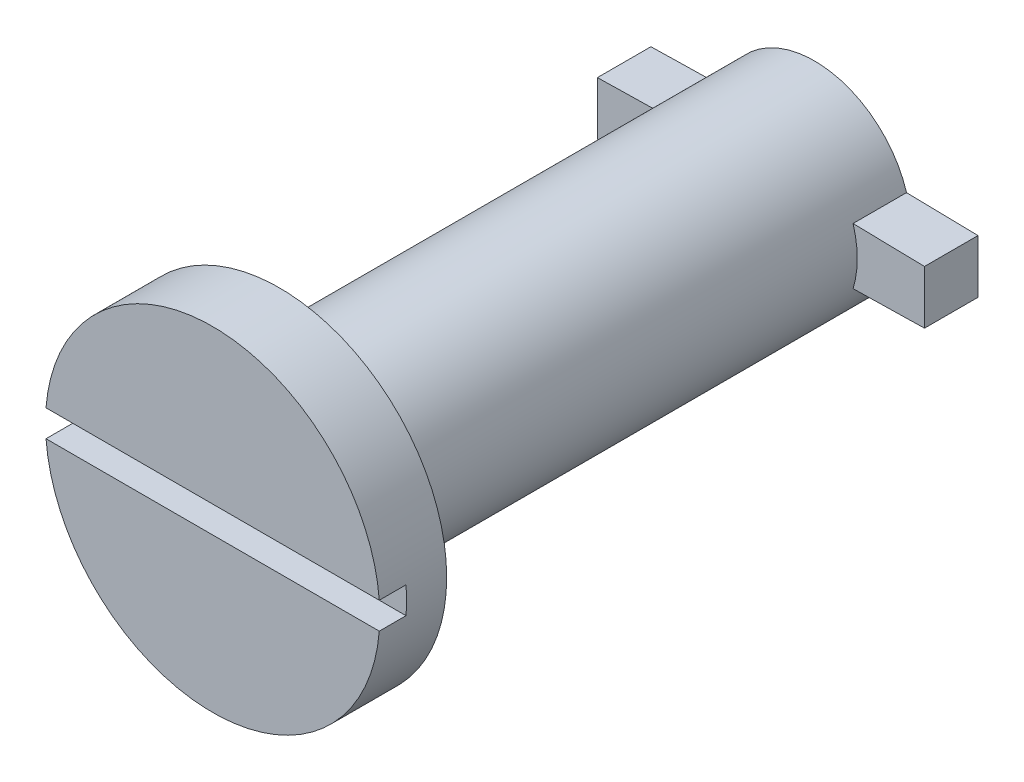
ISO-10303-21;
HEADER;
FILE_DESCRIPTION(('STEP AP214'),'2;1');
FILE_NAME('part.step','',(''),(''),'','','');
FILE_SCHEMA(('AUTOMOTIVE_DESIGN { 1 0 10303 214 1 1 1 1 }'));
ENDSEC;
DATA;
#1=APPLICATION_CONTEXT('core data for automotive mechanical design processes');
#2=APPLICATION_PROTOCOL_DEFINITION('international standard','automotive_design',2000,#1);
#3=PRODUCT_CONTEXT('',#1,'mechanical');
#4=PRODUCT('Part','Part','',(#3));
#5=PRODUCT_RELATED_PRODUCT_CATEGORY('part','',(#4));
#6=PRODUCT_DEFINITION_FORMATION('','',#4);
#7=PRODUCT_DEFINITION_CONTEXT('part definition',#1,'design');
#8=PRODUCT_DEFINITION('design','',#6,#7);
#9=PRODUCT_DEFINITION_SHAPE('','',#8);
#10=(LENGTH_UNIT() NAMED_UNIT(*) SI_UNIT(.MILLI.,.METRE.));
#11=(NAMED_UNIT(*) PLANE_ANGLE_UNIT() SI_UNIT($,.RADIAN.));
#12=(NAMED_UNIT(*) SI_UNIT($,.STERADIAN.) SOLID_ANGLE_UNIT());
#13=UNCERTAINTY_MEASURE_WITH_UNIT(LENGTH_MEASURE(1.E-05),#10,'distance_accuracy_value','');
#14=(GEOMETRIC_REPRESENTATION_CONTEXT(3) GLOBAL_UNCERTAINTY_ASSIGNED_CONTEXT((#13)) GLOBAL_UNIT_ASSIGNED_CONTEXT((#10,
#11,#12)) REPRESENTATION_CONTEXT('',''));
#15=CARTESIAN_POINT('',(0.,0.,0.));
#16=DIRECTION('',(0.,0.,1.));
#17=DIRECTION('',(1.,0.,0.));
#18=AXIS2_PLACEMENT_3D('',#15,#16,#17);
#19=CARTESIAN_POINT('',(29.1872027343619,25.,5.));
#20=DIRECTION('',(0.,0.,1.));
#21=DIRECTION('',(1.,0.,0.));
#22=AXIS2_PLACEMENT_3D('',#19,#20,#21);
#23=PLANE('',#22);
#24=DIRECTION('',(1.,0.,0.));
#25=VECTOR('',#24,1.);
#26=CARTESIAN_POINT('',(29.1872027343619,24.,5.));
#27=LINE('',#26,#25);
#28=CARTESIAN_POINT('',(16.7272669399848,24.,5.));
#29=VERTEX_POINT('',#28);
#30=CARTESIAN_POINT('',(41.6471385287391,24.,5.));
#31=VERTEX_POINT('',#30);
#32=EDGE_CURVE('E219',#29,#31,#27,.T.);
#33=ORIENTED_EDGE('',*,*,#32,.F.);
#34=CARTESIAN_POINT('',(29.1872027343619,25.,5.));
#35=DIRECTION('',(0.,0.,1.));
#36=DIRECTION('',(1.,0.,0.));
#37=AXIS2_PLACEMENT_3D('',#34,#35,#36);
#38=CIRCLE('',#37,12.5);
#39=EDGE_CURVE('E205',#29,#31,#38,.T.);
#40=ORIENTED_EDGE('',*,*,#39,.T.);
#41=EDGE_LOOP('',(#33,#40));
#42=FACE_BOUND('',#41,.T.);
#43=ADVANCED_FACE('F32',(#42),#23,.T.);
#44=CARTESIAN_POINT('',(29.1872027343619,25.,-40.));
#45=DIRECTION('',(0.,0.,1.));
#46=DIRECTION('',(1.,0.,0.));
#47=AXIS2_PLACEMENT_3D('',#44,#45,#46);
#48=CYLINDRICAL_SURFACE('',#47,7.2);
#49=DIRECTION('',(0.,0.,-1.));
#50=VECTOR('',#49,1.);
#51=CARTESIAN_POINT('',(22.3026649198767,22.8921245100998,-36.));
#52=LINE('',#51,#50);
#53=CARTESIAN_POINT('',(22.3026649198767,22.8921245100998,-36.));
#54=VERTEX_POINT('',#53);
#55=CARTESIAN_POINT('',(22.3026649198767,22.8921245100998,-40.));
#56=VERTEX_POINT('',#55);
#57=EDGE_CURVE('E143',#54,#56,#52,.T.);
#58=ORIENTED_EDGE('',*,*,#57,.T.);
#59=CARTESIAN_POINT('',(29.1872027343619,25.,-40.));
#60=DIRECTION('',(0.,0.,1.));
#61=DIRECTION('',(1.,0.,0.));
#62=AXIS2_PLACEMENT_3D('',#59,#60,#61);
#63=CIRCLE('',#62,7.2);
#64=CARTESIAN_POINT('',(36.0717405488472,22.8921245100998,-40.));
#65=VERTEX_POINT('',#64);
#66=EDGE_CURVE('E214',#56,#65,#63,.T.);
#67=ORIENTED_EDGE('',*,*,#66,.T.);
#68=DIRECTION('',(0.,0.,-1.));
#69=VECTOR('',#68,1.);
#70=CARTESIAN_POINT('',(36.0717405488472,22.8921245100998,-36.));
#71=LINE('',#70,#69);
#72=CARTESIAN_POINT('',(36.0717405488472,22.8921245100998,-36.));
#73=VERTEX_POINT('',#72);
#74=EDGE_CURVE('E46',#73,#65,#71,.T.);
#75=ORIENTED_EDGE('',*,*,#74,.F.);
#76=CARTESIAN_POINT('',(29.1872027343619,25.,-36.));
#77=DIRECTION('',(0.,0.,-1.));
#78=DIRECTION('',(-1.,0.,0.));
#79=AXIS2_PLACEMENT_3D('',#76,#77,#78);
#80=CIRCLE('',#79,7.2);
#81=CARTESIAN_POINT('',(36.0717405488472,27.1078754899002,-36.));
#82=VERTEX_POINT('',#81);
#83=EDGE_CURVE('E11',#73,#82,#80,.F.);
#84=ORIENTED_EDGE('',*,*,#83,.T.);
#85=DIRECTION('',(0.,0.,-1.));
#86=VECTOR('',#85,1.);
#87=CARTESIAN_POINT('',(36.0717405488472,27.1078754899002,-36.));
#88=LINE('',#87,#86);
#89=CARTESIAN_POINT('',(36.0717405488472,27.1078754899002,-40.));
#90=VERTEX_POINT('',#89);
#91=EDGE_CURVE('E181',#82,#90,#88,.T.);
#92=ORIENTED_EDGE('',*,*,#91,.T.);
#93=CARTESIAN_POINT('',(22.3026649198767,27.1078754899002,-40.));
#94=VERTEX_POINT('',#93);
#95=EDGE_CURVE('E211',#90,#94,#63,.T.);
#96=ORIENTED_EDGE('',*,*,#95,.T.);
#97=DIRECTION('',(0.,0.,-1.));
#98=VECTOR('',#97,1.);
#99=CARTESIAN_POINT('',(22.3026649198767,27.1078754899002,-36.));
#100=LINE('',#99,#98);
#101=CARTESIAN_POINT('',(22.3026649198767,27.1078754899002,-36.));
#102=VERTEX_POINT('',#101);
#103=EDGE_CURVE('E183',#102,#94,#100,.T.);
#104=ORIENTED_EDGE('',*,*,#103,.F.);
#105=EDGE_CURVE('E36',#102,#54,#80,.F.);
#106=ORIENTED_EDGE('',*,*,#105,.T.);
#107=EDGE_LOOP('',(#58,#67,#75,#84,#92,#96,#104,#106));
#108=FACE_BOUND('',#107,.T.);
#109=CARTESIAN_POINT('',(29.1872027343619,25.,0.));
#110=DIRECTION('',(0.,0.,1.));
#111=DIRECTION('',(1.,0.,0.));
#112=AXIS2_PLACEMENT_3D('',#109,#110,#111);
#113=CIRCLE('',#112,7.2);
#114=CARTESIAN_POINT('',(36.3872027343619,25.,0.));
#115=VERTEX_POINT('',#114);
#116=EDGE_CURVE('E215',#115,#115,#113,.T.);
#117=ORIENTED_EDGE('',*,*,#116,.F.);
#118=EDGE_LOOP('',(#117));
#119=FACE_BOUND('',#118,.T.);
#120=ADVANCED_FACE('F34',(#108,#119),#48,.T.);
#121=CARTESIAN_POINT('',(29.1872027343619,25.,-40.));
#122=DIRECTION('',(0.,0.,1.));
#123=DIRECTION('',(1.,0.,0.));
#124=AXIS2_PLACEMENT_3D('',#121,#122,#123);
#125=PLANE('',#124);
#126=CARTESIAN_POINT('',(29.1872027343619,25.,-40.));
#127=DIRECTION('',(0.,0.,-1.));
#128=DIRECTION('',(-1.,0.,0.));
#129=AXIS2_PLACEMENT_3D('',#126,#127,#128);
#130=CIRCLE('',#129,5.2);
#131=CARTESIAN_POINT('',(23.9872027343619,25.,-40.));
#132=VERTEX_POINT('',#131);
#133=EDGE_CURVE('E150',#132,#132,#130,.T.);
#134=ORIENTED_EDGE('',*,*,#133,.F.);
#135=EDGE_LOOP('',(#134));
#136=FACE_BOUND('',#135,.T.);
#137=ORIENTED_EDGE('',*,*,#95,.F.);
#138=DIRECTION('',(0.999796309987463,-0.0201826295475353,0.));
#139=VECTOR('',#138,1.);
#140=CARTESIAN_POINT('',(36.0717405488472,27.1078754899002,-40.));
#141=LINE('',#140,#139);
#142=CARTESIAN_POINT('',(41.4156188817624,27.,-40.));
#143=VERTEX_POINT('',#142);
#144=EDGE_CURVE('E169',#90,#143,#141,.T.);
#145=ORIENTED_EDGE('',*,*,#144,.T.);
#146=DIRECTION('',(0.,-1.,0.));
#147=VECTOR('',#146,1.);
#148=CARTESIAN_POINT('',(41.4156188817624,27.,-40.));
#149=LINE('',#148,#147);
#150=CARTESIAN_POINT('',(41.4156188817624,23.,-40.));
#151=VERTEX_POINT('',#150);
#152=EDGE_CURVE('E147',#143,#151,#149,.T.);
#153=ORIENTED_EDGE('',*,*,#152,.T.);
#154=DIRECTION('',(-0.999796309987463,-0.0201826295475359,0.));
#155=VECTOR('',#154,1.);
#156=CARTESIAN_POINT('',(41.4156188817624,23.,-40.));
#157=LINE('',#156,#155);
#158=EDGE_CURVE('E144',#151,#65,#157,.T.);
#159=ORIENTED_EDGE('',*,*,#158,.T.);
#160=ORIENTED_EDGE('',*,*,#66,.F.);
#161=DIRECTION('',(-0.999796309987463,0.0201826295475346,0.));
#162=VECTOR('',#161,1.);
#163=CARTESIAN_POINT('',(22.3026649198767,22.8921245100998,-40.));
#164=LINE('',#163,#162);
#165=CARTESIAN_POINT('',(16.9587865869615,23.,-40.));
#166=VERTEX_POINT('',#165);
#167=EDGE_CURVE('E162',#56,#166,#164,.T.);
#168=ORIENTED_EDGE('',*,*,#167,.T.);
#169=DIRECTION('',(0.,1.,0.));
#170=VECTOR('',#169,1.);
#171=CARTESIAN_POINT('',(16.9587865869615,23.,-40.));
#172=LINE('',#171,#170);
#173=CARTESIAN_POINT('',(16.9587865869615,27.,-40.));
#174=VERTEX_POINT('',#173);
#175=EDGE_CURVE('E123',#166,#174,#172,.T.);
#176=ORIENTED_EDGE('',*,*,#175,.T.);
#177=DIRECTION('',(0.999796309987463,0.0201826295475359,0.));
#178=VECTOR('',#177,1.);
#179=CARTESIAN_POINT('',(16.9587865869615,27.,-40.));
#180=LINE('',#179,#178);
#181=EDGE_CURVE('E166',#174,#94,#180,.T.);
#182=ORIENTED_EDGE('',*,*,#181,.T.);
#183=EDGE_LOOP('',(#137,#145,#153,#159,#160,#168,#176,#182));
#184=FACE_BOUND('',#183,.T.);
#185=ADVANCED_FACE('F231',(#136,#184),#125,.F.);
#186=CARTESIAN_POINT('',(29.1872027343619,25.,5.));
#187=DIRECTION('',(0.,0.,-1.));
#188=DIRECTION('',(-1.,0.,0.));
#189=AXIS2_PLACEMENT_3D('',#186,#187,#188);
#190=CYLINDRICAL_SURFACE('',#189,12.5);
#191=ORIENTED_EDGE('',*,*,#39,.F.);
#192=DIRECTION('',(0.,0.,-1.));
#193=VECTOR('',#192,1.);
#194=CARTESIAN_POINT('',(16.7272669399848,24.,5.));
#195=LINE('',#194,#193);
#196=CARTESIAN_POINT('',(16.7272669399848,24.,3.));
#197=VERTEX_POINT('',#196);
#198=EDGE_CURVE('E201',#29,#197,#195,.T.);
#199=ORIENTED_EDGE('',*,*,#198,.T.);
#200=CARTESIAN_POINT('',(29.1872027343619,25.,3.));
#201=DIRECTION('',(0.,0.,1.));
#202=DIRECTION('',(1.,0.,0.));
#203=AXIS2_PLACEMENT_3D('',#200,#201,#202);
#204=CIRCLE('',#203,12.5);
#205=CARTESIAN_POINT('',(16.7272669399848,26.,3.));
#206=VERTEX_POINT('',#205);
#207=EDGE_CURVE('E221',#206,#197,#204,.T.);
#208=ORIENTED_EDGE('',*,*,#207,.F.);
#209=DIRECTION('',(0.,0.,-1.));
#210=VECTOR('',#209,1.);
#211=CARTESIAN_POINT('',(16.7272669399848,26.,5.));
#212=LINE('',#211,#210);
#213=CARTESIAN_POINT('',(16.7272669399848,26.,5.));
#214=VERTEX_POINT('',#213);
#215=EDGE_CURVE('E192',#206,#214,#212,.F.);
#216=ORIENTED_EDGE('',*,*,#215,.T.);
#217=CARTESIAN_POINT('',(41.6471385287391,26.,5.));
#218=VERTEX_POINT('',#217);
#219=EDGE_CURVE('E208',#218,#214,#38,.T.);
#220=ORIENTED_EDGE('',*,*,#219,.F.);
#221=DIRECTION('',(0.,0.,-1.));
#222=VECTOR('',#221,1.);
#223=CARTESIAN_POINT('',(41.6471385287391,26.,5.));
#224=LINE('',#223,#222);
#225=CARTESIAN_POINT('',(41.6471385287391,26.,3.));
#226=VERTEX_POINT('',#225);
#227=EDGE_CURVE('E195',#218,#226,#224,.T.);
#228=ORIENTED_EDGE('',*,*,#227,.T.);
#229=CARTESIAN_POINT('',(41.6471385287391,24.,3.));
#230=VERTEX_POINT('',#229);
#231=EDGE_CURVE('E220',#230,#226,#204,.T.);
#232=ORIENTED_EDGE('',*,*,#231,.F.);
#233=DIRECTION('',(0.,0.,-1.));
#234=VECTOR('',#233,1.);
#235=CARTESIAN_POINT('',(41.6471385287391,24.,5.));
#236=LINE('',#235,#234);
#237=EDGE_CURVE('E198',#230,#31,#236,.F.);
#238=ORIENTED_EDGE('',*,*,#237,.T.);
#239=EDGE_LOOP('',(#191,#199,#208,#216,#220,#228,#232,#238));
#240=FACE_BOUND('',#239,.T.);
#241=CARTESIAN_POINT('',(29.1872027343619,25.,0.));
#242=DIRECTION('',(0.,0.,1.));
#243=DIRECTION('',(1.,0.,0.));
#244=AXIS2_PLACEMENT_3D('',#241,#242,#243);
#245=CIRCLE('',#244,12.5);
#246=CARTESIAN_POINT('',(41.6872027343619,25.,0.));
#247=VERTEX_POINT('',#246);
#248=EDGE_CURVE('E204',#247,#247,#245,.T.);
#249=ORIENTED_EDGE('',*,*,#248,.T.);
#250=EDGE_LOOP('',(#249));
#251=FACE_BOUND('',#250,.T.);
#252=ADVANCED_FACE('F270',(#240,#251),#190,.T.);
#253=DIRECTION('',(-1.,0.,0.));
#254=VECTOR('',#253,1.);
#255=CARTESIAN_POINT('',(29.1872027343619,26.,5.));
#256=LINE('',#255,#254);
#257=EDGE_CURVE('E213',#218,#214,#256,.T.);
#258=ORIENTED_EDGE('',*,*,#257,.F.);
#259=ORIENTED_EDGE('',*,*,#219,.T.);
#260=EDGE_LOOP('',(#258,#259));
#261=FACE_BOUND('',#260,.T.);
#262=ADVANCED_FACE('F261',(#261),#23,.T.);
#263=CARTESIAN_POINT('',(29.1872027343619,25.,0.));
#264=DIRECTION('',(0.,0.,1.));
#265=DIRECTION('',(1.,0.,0.));
#266=AXIS2_PLACEMENT_3D('',#263,#264,#265);
#267=PLANE('',#266);
#268=ORIENTED_EDGE('',*,*,#116,.T.);
#269=EDGE_LOOP('',(#268));
#270=FACE_BOUND('',#269,.T.);
#271=ORIENTED_EDGE('',*,*,#248,.F.);
#272=EDGE_LOOP('',(#271));
#273=FACE_BOUND('',#272,.T.);
#274=ADVANCED_FACE('F269',(#270,#273),#267,.F.);
#275=CARTESIAN_POINT('',(0.,0.,3.));
#276=DIRECTION('',(0.,0.,1.));
#277=DIRECTION('',(1.,0.,0.));
#278=AXIS2_PLACEMENT_3D('',#275,#276,#277);
#279=PLANE('',#278);
#280=DIRECTION('',(-1.,0.,0.));
#281=VECTOR('',#280,1.);
#282=CARTESIAN_POINT('',(30.1872027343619,26.,3.));
#283=LINE('',#282,#281);
#284=EDGE_CURVE('E189',#226,#206,#283,.T.);
#285=ORIENTED_EDGE('',*,*,#284,.T.);
#286=ORIENTED_EDGE('',*,*,#207,.T.);
#287=DIRECTION('',(1.,0.,0.));
#288=VECTOR('',#287,1.);
#289=CARTESIAN_POINT('',(30.1872027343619,24.,3.));
#290=LINE('',#289,#288);
#291=EDGE_CURVE('E175',#197,#230,#290,.T.);
#292=ORIENTED_EDGE('',*,*,#291,.T.);
#293=ORIENTED_EDGE('',*,*,#231,.T.);
#294=EDGE_LOOP('',(#285,#286,#292,#293));
#295=FACE_BOUND('',#294,.T.);
#296=ADVANCED_FACE('F276',(#295),#279,.T.);
#297=CARTESIAN_POINT('',(16.6872027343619,24.,3.));
#298=DIRECTION('',(0.,-1.,0.));
#299=DIRECTION('',(0.,0.,-1.));
#300=AXIS2_PLACEMENT_3D('',#297,#298,#299);
#301=PLANE('',#300);
#302=ORIENTED_EDGE('',*,*,#32,.T.);
#303=ORIENTED_EDGE('',*,*,#237,.F.);
#304=ORIENTED_EDGE('',*,*,#291,.F.);
#305=ORIENTED_EDGE('',*,*,#198,.F.);
#306=EDGE_LOOP('',(#302,#303,#304,#305));
#307=FACE_BOUND('',#306,.T.);
#308=ADVANCED_FACE('F289',(#307),#301,.F.);
#309=CARTESIAN_POINT('',(16.6872027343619,26.,3.));
#310=DIRECTION('',(0.,1.,0.));
#311=DIRECTION('',(0.,0.,1.));
#312=AXIS2_PLACEMENT_3D('',#309,#310,#311);
#313=PLANE('',#312);
#314=ORIENTED_EDGE('',*,*,#257,.T.);
#315=ORIENTED_EDGE('',*,*,#215,.F.);
#316=ORIENTED_EDGE('',*,*,#284,.F.);
#317=ORIENTED_EDGE('',*,*,#227,.F.);
#318=EDGE_LOOP('',(#314,#315,#316,#317));
#319=FACE_BOUND('',#318,.T.);
#320=ADVANCED_FACE('F287',(#319),#313,.F.);
#321=CARTESIAN_POINT('',(16.9587865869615,23.,-36.));
#322=DIRECTION('',(-1.,0.,0.));
#323=DIRECTION('',(0.,-1.,0.));
#324=AXIS2_PLACEMENT_3D('',#321,#322,#323);
#325=PLANE('',#324);
#326=ORIENTED_EDGE('',*,*,#175,.F.);
#327=DIRECTION('',(0.,0.,-1.));
#328=VECTOR('',#327,1.);
#329=CARTESIAN_POINT('',(16.9587865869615,23.,-36.));
#330=LINE('',#329,#328);
#331=CARTESIAN_POINT('',(16.9587865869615,23.,-36.));
#332=VERTEX_POINT('',#331);
#333=EDGE_CURVE('E118',#332,#166,#330,.T.);
#334=ORIENTED_EDGE('',*,*,#333,.F.);
#335=DIRECTION('',(0.,1.,0.));
#336=VECTOR('',#335,1.);
#337=CARTESIAN_POINT('',(16.9587865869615,23.,-36.));
#338=LINE('',#337,#336);
#339=CARTESIAN_POINT('',(16.9587865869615,27.,-36.));
#340=VERTEX_POINT('',#339);
#341=EDGE_CURVE('E121',#332,#340,#338,.T.);
#342=ORIENTED_EDGE('',*,*,#341,.T.);
#343=DIRECTION('',(0.,0.,-1.));
#344=VECTOR('',#343,1.);
#345=CARTESIAN_POINT('',(16.9587865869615,27.,-36.));
#346=LINE('',#345,#344);
#347=EDGE_CURVE('E128',#340,#174,#346,.T.);
#348=ORIENTED_EDGE('',*,*,#347,.T.);
#349=EDGE_LOOP('',(#326,#334,#342,#348));
#350=FACE_BOUND('',#349,.T.);
#351=ADVANCED_FACE('F120',(#350),#325,.T.);
#352=CARTESIAN_POINT('',(29.1872027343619,25.,-36.));
#353=DIRECTION('',(0.,0.,-1.));
#354=DIRECTION('',(-1.,0.,0.));
#355=AXIS2_PLACEMENT_3D('',#352,#353,#354);
#356=PLANE('',#355);
#357=ORIENTED_EDGE('',*,*,#105,.F.);
#358=DIRECTION('',(0.999796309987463,0.0201826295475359,0.));
#359=VECTOR('',#358,1.);
#360=CARTESIAN_POINT('',(16.9587865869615,27.,-36.));
#361=LINE('',#360,#359);
#362=EDGE_CURVE('E138',#340,#102,#361,.T.);
#363=ORIENTED_EDGE('',*,*,#362,.F.);
#364=ORIENTED_EDGE('',*,*,#341,.F.);
#365=DIRECTION('',(-0.999796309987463,0.0201826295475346,0.));
#366=VECTOR('',#365,1.);
#367=CARTESIAN_POINT('',(22.3026649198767,22.8921245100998,-36.));
#368=LINE('',#367,#366);
#369=EDGE_CURVE('E136',#54,#332,#368,.T.);
#370=ORIENTED_EDGE('',*,*,#369,.F.);
#371=EDGE_LOOP('',(#357,#363,#364,#370));
#372=FACE_BOUND('',#371,.T.);
#373=ADVANCED_FACE('F135',(#372),#356,.F.);
#374=CARTESIAN_POINT('',(16.9587865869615,27.,-36.));
#375=DIRECTION('',(-0.0201826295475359,0.999796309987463,0.));
#376=DIRECTION('',(-0.999796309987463,-0.0201826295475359,0.));
#377=AXIS2_PLACEMENT_3D('',#374,#375,#376);
#378=PLANE('',#377);
#379=ORIENTED_EDGE('',*,*,#181,.F.);
#380=ORIENTED_EDGE('',*,*,#347,.F.);
#381=ORIENTED_EDGE('',*,*,#362,.T.);
#382=ORIENTED_EDGE('',*,*,#103,.T.);
#383=EDGE_LOOP('',(#379,#380,#381,#382));
#384=FACE_BOUND('',#383,.T.);
#385=ADVANCED_FACE('F229',(#384),#378,.T.);
#386=CARTESIAN_POINT('',(22.3026649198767,22.8921245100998,-36.));
#387=DIRECTION('',(-0.0201826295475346,-0.999796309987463,0.));
#388=DIRECTION('',(0.999796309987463,-0.0201826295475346,0.));
#389=AXIS2_PLACEMENT_3D('',#386,#387,#388);
#390=PLANE('',#389);
#391=ORIENTED_EDGE('',*,*,#167,.F.);
#392=ORIENTED_EDGE('',*,*,#57,.F.);
#393=ORIENTED_EDGE('',*,*,#369,.T.);
#394=ORIENTED_EDGE('',*,*,#333,.T.);
#395=EDGE_LOOP('',(#391,#392,#393,#394));
#396=FACE_BOUND('',#395,.T.);
#397=ADVANCED_FACE('F141',(#396),#390,.T.);
#398=ORIENTED_EDGE('',*,*,#83,.F.);
#399=DIRECTION('',(-0.999796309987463,-0.0201826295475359,0.));
#400=VECTOR('',#399,1.);
#401=CARTESIAN_POINT('',(41.4156188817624,23.,-36.));
#402=LINE('',#401,#400);
#403=CARTESIAN_POINT('',(41.4156188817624,23.,-36.));
#404=VERTEX_POINT('',#403);
#405=EDGE_CURVE('E129',#404,#73,#402,.T.);
#406=ORIENTED_EDGE('',*,*,#405,.F.);
#407=DIRECTION('',(0.,-1.,0.));
#408=VECTOR('',#407,1.);
#409=CARTESIAN_POINT('',(41.4156188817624,27.,-36.));
#410=LINE('',#409,#408);
#411=CARTESIAN_POINT('',(41.4156188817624,27.,-36.));
#412=VERTEX_POINT('',#411);
#413=EDGE_CURVE('E157',#412,#404,#410,.T.);
#414=ORIENTED_EDGE('',*,*,#413,.F.);
#415=DIRECTION('',(0.999796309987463,-0.0201826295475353,0.));
#416=VECTOR('',#415,1.);
#417=CARTESIAN_POINT('',(36.0717405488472,27.1078754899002,-36.));
#418=LINE('',#417,#416);
#419=EDGE_CURVE('E154',#82,#412,#418,.T.);
#420=ORIENTED_EDGE('',*,*,#419,.F.);
#421=EDGE_LOOP('',(#398,#406,#414,#420));
#422=FACE_BOUND('',#421,.T.);
#423=ADVANCED_FACE('F238',(#422),#356,.F.);
#424=CARTESIAN_POINT('',(41.4156188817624,23.,-36.));
#425=DIRECTION('',(0.0201826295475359,-0.999796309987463,0.));
#426=DIRECTION('',(0.999796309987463,0.0201826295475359,0.));
#427=AXIS2_PLACEMENT_3D('',#424,#425,#426);
#428=PLANE('',#427);
#429=ORIENTED_EDGE('',*,*,#158,.F.);
#430=DIRECTION('',(0.,0.,-1.));
#431=VECTOR('',#430,1.);
#432=CARTESIAN_POINT('',(41.4156188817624,23.,-36.));
#433=LINE('',#432,#431);
#434=EDGE_CURVE('E177',#404,#151,#433,.T.);
#435=ORIENTED_EDGE('',*,*,#434,.F.);
#436=ORIENTED_EDGE('',*,*,#405,.T.);
#437=ORIENTED_EDGE('',*,*,#74,.T.);
#438=EDGE_LOOP('',(#429,#435,#436,#437));
#439=FACE_BOUND('',#438,.T.);
#440=ADVANCED_FACE('F234',(#439),#428,.T.);
#441=CARTESIAN_POINT('',(41.4156188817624,27.,-36.));
#442=DIRECTION('',(1.,0.,0.));
#443=DIRECTION('',(0.,0.,-1.));
#444=AXIS2_PLACEMENT_3D('',#441,#442,#443);
#445=PLANE('',#444);
#446=ORIENTED_EDGE('',*,*,#152,.F.);
#447=DIRECTION('',(0.,0.,-1.));
#448=VECTOR('',#447,1.);
#449=CARTESIAN_POINT('',(41.4156188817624,27.,-36.));
#450=LINE('',#449,#448);
#451=EDGE_CURVE('E179',#412,#143,#450,.T.);
#452=ORIENTED_EDGE('',*,*,#451,.F.);
#453=ORIENTED_EDGE('',*,*,#413,.T.);
#454=ORIENTED_EDGE('',*,*,#434,.T.);
#455=EDGE_LOOP('',(#446,#452,#453,#454));
#456=FACE_BOUND('',#455,.T.);
#457=ADVANCED_FACE('F242',(#456),#445,.T.);
#458=CARTESIAN_POINT('',(36.0717405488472,27.1078754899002,-36.));
#459=DIRECTION('',(0.0201826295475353,0.999796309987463,0.));
#460=DIRECTION('',(-0.999796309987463,0.0201826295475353,0.));
#461=AXIS2_PLACEMENT_3D('',#458,#459,#460);
#462=PLANE('',#461);
#463=ORIENTED_EDGE('',*,*,#144,.F.);
#464=ORIENTED_EDGE('',*,*,#91,.F.);
#465=ORIENTED_EDGE('',*,*,#419,.T.);
#466=ORIENTED_EDGE('',*,*,#451,.T.);
#467=EDGE_LOOP('',(#463,#464,#465,#466));
#468=FACE_BOUND('',#467,.T.);
#469=ADVANCED_FACE('F245',(#468),#462,.T.);
#470=CARTESIAN_POINT('',(29.1872027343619,25.,-10.));
#471=DIRECTION('',(0.,0.,-1.));
#472=DIRECTION('',(-1.,0.,0.));
#473=AXIS2_PLACEMENT_3D('',#470,#471,#472);
#474=CYLINDRICAL_SURFACE('',#473,5.2);
#475=CARTESIAN_POINT('',(29.1872027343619,25.,-10.));
#476=DIRECTION('',(0.,0.,-1.));
#477=DIRECTION('',(-1.,0.,0.));
#478=AXIS2_PLACEMENT_3D('',#475,#476,#477);
#479=CIRCLE('',#478,5.2);
#480=CARTESIAN_POINT('',(23.9872027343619,25.,-10.));
#481=VERTEX_POINT('',#480);
#482=EDGE_CURVE('E164',#481,#481,#479,.T.);
#483=ORIENTED_EDGE('',*,*,#482,.F.);
#484=EDGE_LOOP('',(#483));
#485=FACE_BOUND('',#484,.T.);
#486=ORIENTED_EDGE('',*,*,#133,.T.);
#487=EDGE_LOOP('',(#486));
#488=FACE_BOUND('',#487,.T.);
#489=ADVANCED_FACE('F247',(#485,#488),#474,.F.);
#490=CARTESIAN_POINT('',(29.1872027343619,25.,-10.));
#491=DIRECTION('',(0.,0.,-1.));
#492=DIRECTION('',(-1.,0.,0.));
#493=AXIS2_PLACEMENT_3D('',#490,#491,#492);
#494=PLANE('',#493);
#495=ORIENTED_EDGE('',*,*,#482,.T.);
#496=EDGE_LOOP('',(#495));
#497=FACE_BOUND('',#496,.T.);
#498=ADVANCED_FACE('F253',(#497),#494,.T.);
#499=CLOSED_SHELL('',(#43,#120,#185,#252,#262,#274,#296,#308,#320,#351,#373,#385,#397,#423,#440,
#457,#469,#489,#498));
#500=MANIFOLD_SOLID_BREP('B2',#499);
#501=ADVANCED_BREP_SHAPE_REPRESENTATION('',(#18,#500),#14);
#502=SHAPE_DEFINITION_REPRESENTATION(#9,#501);
ENDSEC;
END-ISO-10303-21;
